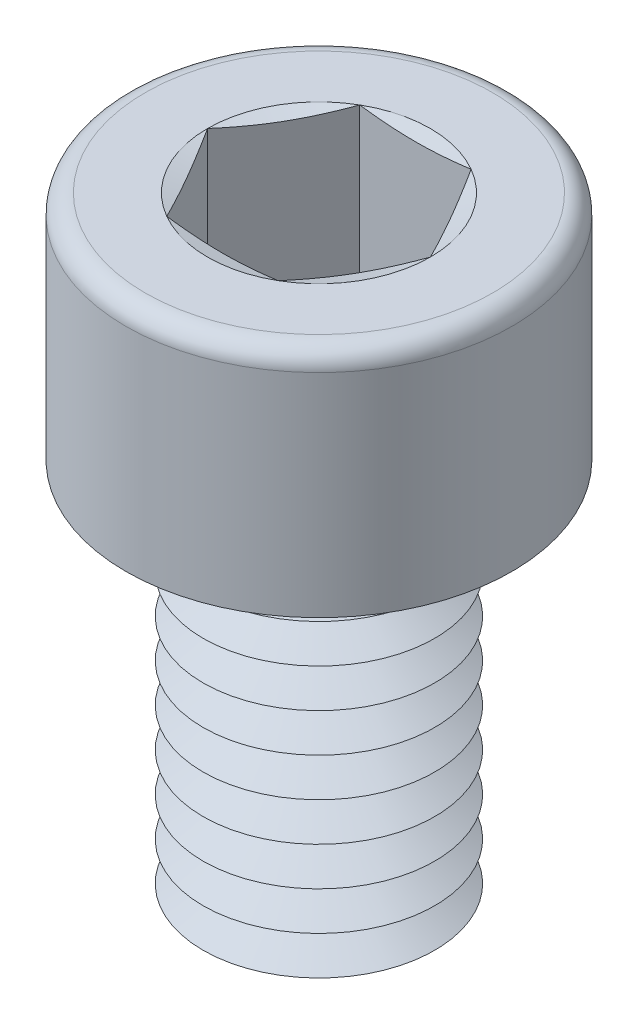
from build123d import *

# Parameters (mm, degrees)
SKETCH1_R       = 3
EXTRUDE1_DEPTH  = 10
SKETCH2_R       = 5
EXTRUDE2_DEPTH  = 6
EXTRUDE3_DEPTH  = 5
FILLET1_R       = 0.5
LPATTERN1_COUNT = 10
LPATTERN1_PITCH = 1


with BuildPart() as part:
    # Sketch1 → Extrude1 (new body)
    with BuildSketch(Plane(origin=(0, 0, 0), x_dir=(1, 0, 0), z_dir=(0, 1, 0))):
        with Locations(Location((0, 0, 0), (0, 0, 270))):
            Circle(SKETCH1_R)
    extrude(amount=EXTRUDE1_DEPTH)

    # Sketch2 → Extrude2 (add)
    with BuildSketch(Plane(origin=(0, 10, 0), x_dir=(1, 0, 0), z_dir=(0, 1, 0))):
        with Locations(Location((0, 0, 0), (0, 0, 270))):
            Circle(SKETCH2_R)
    extrude(amount=EXTRUDE2_DEPTH)

    # Sketch3 → Extrude3 (cut)
    with BuildSketch(Plane(origin=(0, 16, 0), x_dir=(1, 0, 0), z_dir=(0, 1, 0))):
        Polygon((1.443375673, 2.5), (-1.443375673, 2.5), (-2.886751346, 0), (-1.443375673, -2.5), (1.443375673, -2.5), (2.886751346, 0), align=None)
    extrude(amount=-EXTRUDE3_DEPTH, mode=Mode.SUBTRACT)

    # Fillet1
    fillet1_edges = [part.edges().sort_by_distance(p)[0] for p in [
        (0, 16, -5),
    ]]
    fillet(fillet1_edges, radius=FILLET1_R)

    # Sketch4 → Cut-Revolve1 (revolve, cut)
    with BuildSketch(Plane(origin=(0, 0, 0), x_dir=(0, 0, -1), z_dir=(1, 0, 0))):
        Polygon((-2.5, 11), (0, 11), (0, 9.556624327), align=None)
    revolve(axis=Axis((0, 11, 0), (0, -1, 0)), mode=Mode.SUBTRACT)

    # Sketch5 → Cut-Revolve2 (revolve, cut)
    with BuildSketch(Plane.XY, mode=Mode.PRIVATE) as cut_revolve2_sk:
        Polygon((-3, 0.5), (-3, -0.5), (-2.133974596, 0), align=None)
    cut_revolve2 = revolve(cut_revolve2_sk.sketch.rotate(Axis((0, 10, 0), (0, -1, 0)), 270), axis=Axis((0, 10, 0), (0, -1, 0)), mode=Mode.SUBTRACT)

    # LPattern1: Cut-Revolve2 ×10
    with Locations(*[(0, i * LPATTERN1_PITCH, 0) for i in range(1, LPATTERN1_COUNT)]):
        add(cut_revolve2, mode=Mode.SUBTRACT)

    # Extrude4 cone 1 section (on through the dimple's axis) → Extrude4 (revolve, cut)
    with BuildSketch(Plane(origin=(0, 16, 0), x_dir=(0, 0, 1), z_dir=(1, 0, 0))):
        Polygon((0, 0), (2.886751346, 0), (0, 0.773502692), align=None)
    revolve(axis=Axis((0, 16, 0), (0, -1, 0)), mode=Mode.SUBTRACT)


solid = part.part
